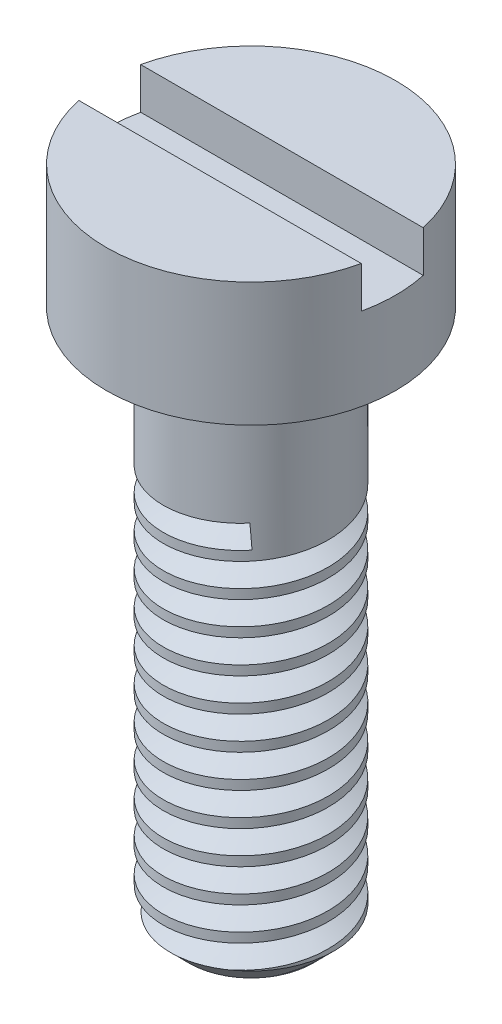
from build123d import *

# Parameters (mm, degrees)
CHANFREIN1_SIZE              = 0.25
ENL_V_MAT_EXTRU_1_DEPTH      = 9.374067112
ENL_V_MAT_EXTRU_1_DEPTH_BACK = 9.374067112
ESQUISSE2_W                  = 0.75
ESQUISSE2_H                  = 0.5


with BuildPart() as part:
    # Esquisse1 → R_volution1 (revolve)
    with BuildSketch(Plane.XY, mode=Mode.PRIVATE) as r_volution1_sk:
        Polygon((0, 0), (0, 8), (1.75, 8), (1.75, 6.5), (1, 6.5), (1, 0), align=None)
    revolve(r_volution1_sk.sketch.rotate(Axis((0, 0, 0), (0, 1, 0)), 90), axis=Axis((0, 0, 0), (0, 1, 0)))

    # Chanfrein1
    chanfrein1_edges = [part.edges().sort_by_distance(p)[0] for p in [
        (0, 0, 1),
    ]]
    chamfer(chanfrein1_edges, length=CHANFREIN1_SIZE)

    # Esquisse2 → Enl_v. mat.-Extru.1 (cut, two sides: drawn at the far end of the back side and taken through both)
    with BuildSketch(Plane(origin=(0, 0, 0), x_dir=(0, 0, -1), z_dir=(1, 0, 0)).offset(-ENL_V_MAT_EXTRU_1_DEPTH_BACK)):
        with Locations((0, 7.75)):
            Rectangle(ESQUISSE2_W, ESQUISSE2_H)
    extrude(amount=ENL_V_MAT_EXTRU_1_DEPTH + ENL_V_MAT_EXTRU_1_DEPTH_BACK, mode=Mode.SUBTRACT)

    # Enl_vement de mati_re-Balayage1: sweep along a curve in space
    with BuildLine() as enl_vement_de_mati_re_balayage1_path:
        add(Edge.make_bspline(
            [(0.7071067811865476, 0, 0.70710678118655), (0.799075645, 0.008280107, 0.615137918), (0.948200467, 0.025024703, 0.392377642), (1.025962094, 0.049993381, 7.197e-05), (0.947951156, 0.075001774, -0.392665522), (0.725510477, 0.099999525, -0.725510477), (0.392647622, 0.125000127, -0.947933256), (-3.71e-07, 0.149999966, -1.026033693), (-0.392646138, 0.175000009, -0.947931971), (-0.725515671, 0.199999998, -0.725515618), (-0.947931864, 0.225000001, -0.392646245), (-1.026034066, 0.25, 2e-09), (-0.947931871, 0.275, 0.392646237), (-0.725515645, 0.3, 0.725515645), (-0.392646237, 0.325, 0.947931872), (0, 0.35, 1.026034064), (0.392646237, 0.375, 0.947931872), (0.725515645, 0.4, 0.725515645), (0.947931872, 0.425, 0.392646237), (1.026034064, 0.45, 0), (0.947931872, 0.475, -0.392646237), (0.725515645, 0.5, -0.725515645), (0.392646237, 0.525, -0.947931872), (0, 0.55, -1.026034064), (-0.392646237, 0.575, -0.947931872), (-0.725515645, 0.6, -0.725515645), (-0.947931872, 0.625, -0.392646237), (-1.026034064, 0.65, 0), (-0.947931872, 0.675, 0.392646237), (-0.725515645, 0.7, 0.725515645), (-0.392646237, 0.725, 0.947931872), (0, 0.75, 1.026034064), (0.392646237, 0.775, 0.947931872), (0.725515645, 0.8, 0.725515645), (0.947931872, 0.825, 0.392646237), (1.026034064, 0.85, 0), (0.947931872, 0.875, -0.392646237), (0.725515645, 0.9, -0.725515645), (0.392646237, 0.925, -0.947931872), (0, 0.95, -1.026034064), (-0.392646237, 0.975, -0.947931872), (-0.725515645, 1, -0.725515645), (-0.947931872, 1.025, -0.392646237), (-1.026034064, 1.05, 0), (-0.947931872, 1.075, 0.392646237), (-0.725515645, 1.1, 0.725515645), (-0.392646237, 1.125, 0.947931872), (0, 1.15, 1.026034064), (0.392646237, 1.175, 0.947931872), (0.725515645, 1.2, 0.725515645), (0.947931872, 1.225, 0.392646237), (1.026034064, 1.25, 0), (0.947931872, 1.275, -0.392646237), (0.725515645, 1.3, -0.725515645), (0.392646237, 1.325, -0.947931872), (0, 1.35, -1.026034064), (-0.392646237, 1.375, -0.947931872), (-0.725515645, 1.4, -0.725515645), (-0.947931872, 1.425, -0.392646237), (-1.026034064, 1.45, 0), (-0.947931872, 1.475, 0.392646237), (-0.725515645, 1.5, 0.725515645), (-0.392646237, 1.525, 0.947931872), (0, 1.55, 1.026034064), (0.392646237, 1.575, 0.947931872), (0.725515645, 1.6, 0.725515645), (0.947931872, 1.625, 0.392646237), (1.026034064, 1.65, 0), (0.947931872, 1.675, -0.392646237), (0.725515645, 1.7, -0.725515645), (0.392646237, 1.725, -0.947931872), (0, 1.75, -1.026034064), (-0.392646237, 1.775, -0.947931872), (-0.725515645, 1.8, -0.725515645), (-0.947931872, 1.825, -0.392646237), (-1.026034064, 1.85, 0), (-0.947931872, 1.875, 0.392646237), (-0.725515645, 1.9, 0.725515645), (-0.392646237, 1.925, 0.947931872), (0, 1.95, 1.026034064), (0.392646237, 1.975, 0.947931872), (0.725515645, 2, 0.725515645), (0.947931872, 2.025, 0.392646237), (1.026034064, 2.05, 0), (0.947931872, 2.075, -0.392646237), (0.725515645, 2.1, -0.725515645), (0.392646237, 2.125, -0.947931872), (0, 2.15, -1.026034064), (-0.392646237, 2.175, -0.947931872), (-0.725515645, 2.2, -0.725515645), (-0.947931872, 2.225, -0.392646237), (-1.026034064, 2.25, 0), (-0.947931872, 2.275, 0.392646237), (-0.725515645, 2.3, 0.725515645), (-0.392646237, 2.325, 0.947931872), (0, 2.35, 1.026034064), (0.392646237, 2.375, 0.947931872), (0.725515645, 2.4, 0.725515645), (0.947931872, 2.425, 0.392646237), (1.026034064, 2.45, 0), (0.947931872, 2.475, -0.392646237), (0.725515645, 2.5, -0.725515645), (0.392646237, 2.525, -0.947931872), (0, 2.55, -1.026034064), (-0.392646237, 2.575, -0.947931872), (-0.725515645, 2.6, -0.725515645), (-0.947931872, 2.625, -0.392646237), (-1.026034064, 2.65, 0), (-0.947931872, 2.675, 0.392646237), (-0.725515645, 2.7, 0.725515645), (-0.392646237, 2.725, 0.947931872), (0, 2.75, 1.026034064), (0.392646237, 2.775, 0.947931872), (0.725515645, 2.8, 0.725515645), (0.947931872, 2.825, 0.392646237), (1.026034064, 2.85, 0), (0.947931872, 2.875, -0.392646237), (0.725515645, 2.9, -0.725515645), (0.392646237, 2.925, -0.947931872), (0, 2.95, -1.026034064), (-0.392646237, 2.975, -0.947931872), (-0.725515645, 3, -0.725515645), (-0.947931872, 3.025, -0.392646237), (-1.026034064, 3.05, 0), (-0.947931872, 3.075, 0.392646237), (-0.725515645, 3.1, 0.725515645), (-0.392646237, 3.125, 0.947931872), (0, 3.15, 1.026034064), (0.392646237, 3.175, 0.947931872), (0.725515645, 3.2, 0.725515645), (0.947931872, 3.225, 0.392646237), (1.026034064, 3.25, 0), (0.947931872, 3.275, -0.392646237), (0.725515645, 3.3, -0.725515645), (0.392646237, 3.325, -0.947931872), (0, 3.35, -1.026034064), (-0.392646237, 3.375, -0.947931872), (-0.725515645, 3.4, -0.725515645), (-0.947931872, 3.425, -0.392646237), (-1.026034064, 3.45, 0), (-0.947931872, 3.475, 0.392646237), (-0.725515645, 3.5, 0.725515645), (-0.392646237, 3.525, 0.947931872), (0, 3.55, 1.026034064), (0.392646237, 3.575, 0.947931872), (0.725515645, 3.6, 0.725515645), (0.947931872, 3.625, 0.392646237), (1.026034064, 3.65, 0), (0.947931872, 3.675, -0.392646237), (0.725515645, 3.7, -0.725515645), (0.392646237, 3.725, -0.947931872), (0, 3.75, -1.026034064), (-0.392646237, 3.775, -0.947931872), (-0.725515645, 3.8, -0.725515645), (-0.947931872, 3.825, -0.392646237), (-1.026034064, 3.85, 0), (-0.947931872, 3.875, 0.392646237), (-0.725515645, 3.9, 0.725515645), (-0.392646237, 3.925, 0.947931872), (0, 3.95, 1.026034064), (0.392646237, 3.975, 0.947931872), (0.725515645, 4, 0.725515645), (0.947931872, 4.025, 0.392646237), (1.026034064, 4.05, 0), (0.947931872, 4.075, -0.392646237), (0.725515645, 4.1, -0.725515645), (0.392646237, 4.125, -0.947931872), (0, 4.15, -1.026034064), (-0.392646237, 4.175, -0.947931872), (-0.725515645, 4.2, -0.725515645), (-0.947931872, 4.225, -0.392646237), (-1.026034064, 4.25, 0), (-0.947931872, 4.275, 0.392646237), (-0.725515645, 4.3, 0.725515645), (-0.392646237, 4.325, 0.947931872), (0, 4.35, 1.026034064), (0.392646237, 4.375, 0.947931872), (0.725515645, 4.4, 0.725515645), (0.947931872, 4.425, 0.392646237), (1.026034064, 4.45, 0), (0.947931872, 4.475, -0.392646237), (0.725515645, 4.5, -0.725515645), (0.392646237, 4.525, -0.947931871), (2e-09, 4.55, -1.026034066), (-0.392646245, 4.574999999, -0.947931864), (-0.725515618, 4.600000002, -0.725515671), (-0.947931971, 4.624999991, -0.392646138), (-1.026033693, 4.650000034, -3.71e-07), (-0.947933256, 4.674999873, 0.392647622), (-0.725510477, 4.700000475, 0.725510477), (-0.392665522, 4.724998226, 0.947951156), (7.197e-05, 4.750006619, 1.025962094), (0.392377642, 4.774975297, 0.948200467), (0.615137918, 4.791719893, 0.799075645), (0.707106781, 4.8, 0.707106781)],
            knots=[0, 0, 0, 0, 0.005208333, 0.010416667, 0.015625, 0.020833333, 0.026041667, 0.03125, 0.036458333, 0.041666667, 0.046875, 0.052083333, 0.057291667, 0.0625, 0.067708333, 0.072916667, 0.078125, 0.083333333, 0.088541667, 0.09375, 0.098958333, 0.104166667, 0.109375, 0.114583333, 0.119791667, 0.125, 0.130208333, 0.135416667, 0.140625, 0.145833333, 0.151041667, 0.15625, 0.161458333, 0.166666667, 0.171875, 0.177083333, 0.182291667, 0.1875, 0.192708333, 0.197916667, 0.203125, 0.208333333, 0.213541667, 0.21875, 0.223958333, 0.229166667, 0.234375, 0.239583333, 0.244791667, 0.25, 0.255208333, 0.260416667, 0.265625, 0.270833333, 0.276041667, 0.28125, 0.286458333, 0.291666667, 0.296875, 0.302083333, 0.307291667, 0.3125, 0.317708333, 0.322916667, 0.328125, 0.333333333, 0.338541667, 0.34375, 0.348958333, 0.354166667, 0.359375, 0.364583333, 0.369791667, 0.375, 0.380208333, 0.385416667, 0.390625, 0.395833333, 0.401041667, 0.40625, 0.411458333, 0.416666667, 0.421875, 0.427083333, 0.432291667, 0.4375, 0.442708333, 0.447916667, 0.453125, 0.458333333, 0.463541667, 0.46875, 0.473958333, 0.479166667, 0.484375, 0.489583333, 0.494791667, 0.5, 0.505208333, 0.510416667, 0.515625, 0.520833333, 0.526041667, 0.53125, 0.536458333, 0.541666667, 0.546875, 0.552083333, 0.557291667, 0.5625, 0.567708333, 0.572916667, 0.578125, 0.583333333, 0.588541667, 0.59375, 0.598958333, 0.604166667, 0.609375, 0.614583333, 0.619791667, 0.625, 0.630208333, 0.635416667, 0.640625, 0.645833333, 0.651041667, 0.65625, 0.661458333, 0.666666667, 0.671875, 0.677083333, 0.682291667, 0.6875, 0.692708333, 0.697916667, 0.703125, 0.708333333, 0.713541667, 0.71875, 0.723958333, 0.729166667, 0.734375, 0.739583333, 0.744791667, 0.75, 0.755208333, 0.760416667, 0.765625, 0.770833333, 0.776041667, 0.78125, 0.786458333, 0.791666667, 0.796875, 0.802083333, 0.807291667, 0.8125, 0.817708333, 0.822916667, 0.828125, 0.833333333, 0.838541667, 0.84375, 0.848958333, 0.854166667, 0.859375, 0.864583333, 0.869791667, 0.875, 0.880208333, 0.885416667, 0.890625, 0.895833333, 0.901041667, 0.90625, 0.911458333, 0.916666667, 0.921875, 0.927083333, 0.932291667, 0.9375, 0.942708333, 0.947916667, 0.953125, 0.958333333, 0.963541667, 0.96875, 0.973958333, 0.979166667, 0.984375, 0.989583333, 0.994791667, 1, 1, 1, 1], degree=3))
    # Esquisse4 → Enl_vement de mati_re-Balayage1 (sweep, cut)
    with BuildSketch(Plane(origin=(0.7071067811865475, 0, 0.70710678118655), x_dir=(-0.7028354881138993, -0.06327742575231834, -0.7085324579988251), z_dir=(0.7056782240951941, 0.06353336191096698, -0.7056782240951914))):
        Polygon((0, 0.144337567), (0.25, 0), (0, -0.144337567), (-0.226746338, -0.144337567), (-0.226746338, 0.144337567), align=None)
    sweep(path=enl_vement_de_mati_re_balayage1_path.line, is_frenet=True, mode=Mode.SUBTRACT)


solid = part.part
